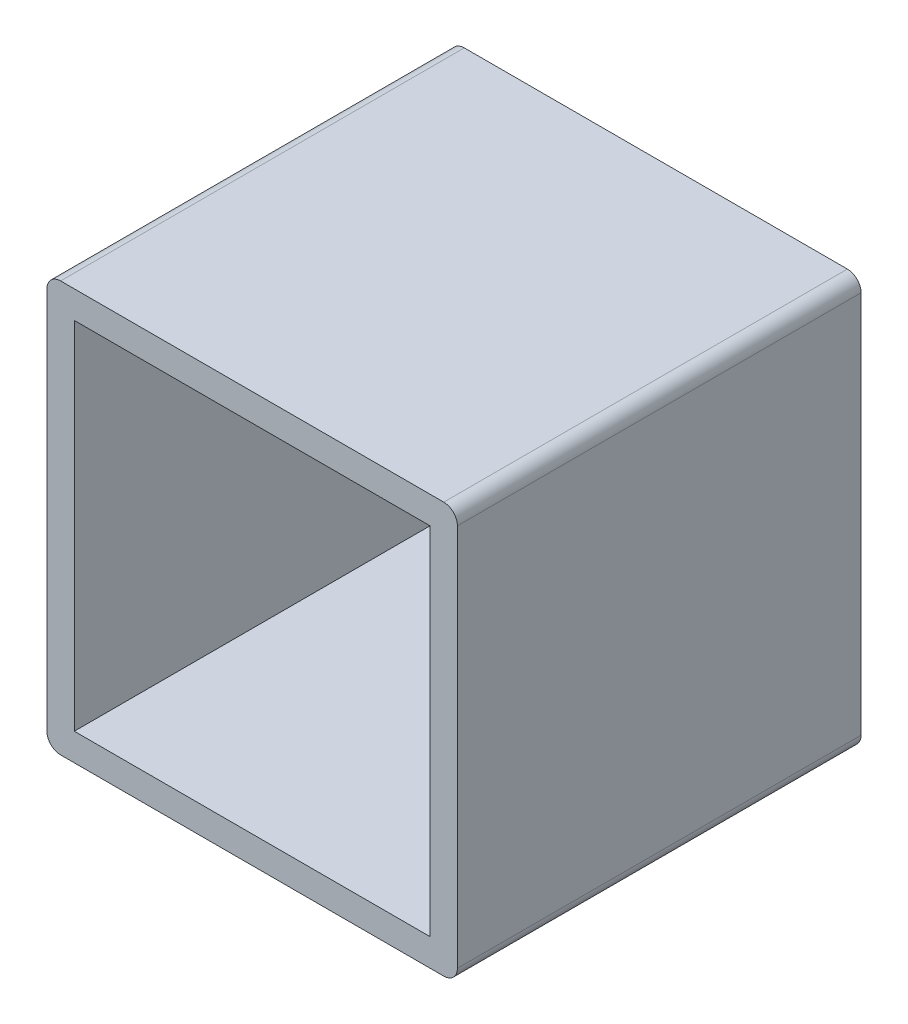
from build123d import *

# Parameters (mm, degrees)
ESQUISSE1_W            = 26
ESQUISSE1_H            = 26
BASE_EXTRU_MINCE_DEPTH = 29.5


with BuildPart() as part:
    # Esquisse1 → Base-Extru.-Mince (new body)
    with BuildSketch(Plane.XY):
        with BuildLine():
            Line((14, -15), (-14, -15))
            ThreePointArc((-14, -15), (-14.707106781, -14.707106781), (-15, -14))
            Line((-15, -14), (-15, 14))
            ThreePointArc((-15, 14), (-14.707106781, 14.707106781), (-14, 15))
            Line((-14, 15), (14, 15))
            ThreePointArc((14, 15), (14.707106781, 14.707106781), (15, 14))
            Line((15, 14), (15, -14))
            ThreePointArc((15, -14), (14.707106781, -14.707106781), (14, -15))
        make_face()
        Rectangle(ESQUISSE1_W, ESQUISSE1_H, mode=Mode.SUBTRACT)
    extrude(amount=BASE_EXTRU_MINCE_DEPTH)


solid = part.part
